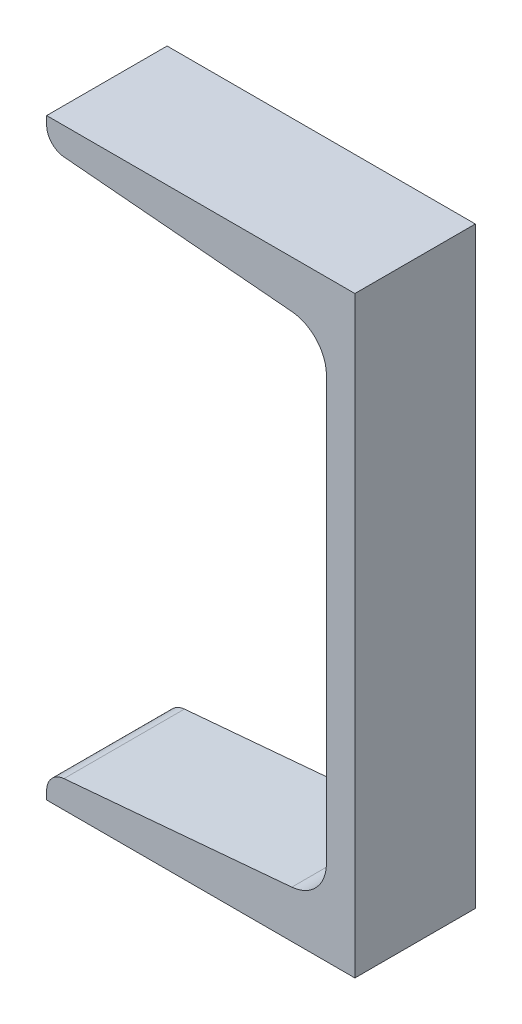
from build123d import *

# Parameters (mm, degrees)
BASESECTION_DEPTH = 12.7


with BuildPart() as part:
    # Sketch1 → BaseSection (new, symmetric)
    with BuildSketch(Plane.XY):
        with BuildLine():
            Line((-65, 62.5), (0, 62.5))
            Line((0, 62.5), (0, -62.5))
            Line((0, -62.5), (-65, -62.5))
            Line((-65, -62.5), (-65, -60.74624027))
            ThreePointArc((-65, -60.74624027), (-63.949109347, -58.04387944), (-61.348622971, -56.761461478))
            Line((-61.348622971, -56.761461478), (-13.302754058, -52.557992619))
            ThreePointArc((-13.302754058, -52.557992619), (-8.101781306, -49.993156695), (-6, -44.588435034))
            Line((-6, -44.588435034), (-6, 44.588435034))
            ThreePointArc((-6, 44.588435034), (-8.101781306, 49.993156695), (-13.302754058, 52.557992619))
            Line((-13.302754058, 52.557992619), (-61.348622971, 56.761461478))
            ThreePointArc((-61.348622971, 56.761461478), (-63.949109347, 58.04387944), (-65, 60.74624027))
            Line((-65, 60.74624027), (-65, 62.5))
        make_face()
    extrude(amount=BASESECTION_DEPTH, both=True)


solid = part.part
